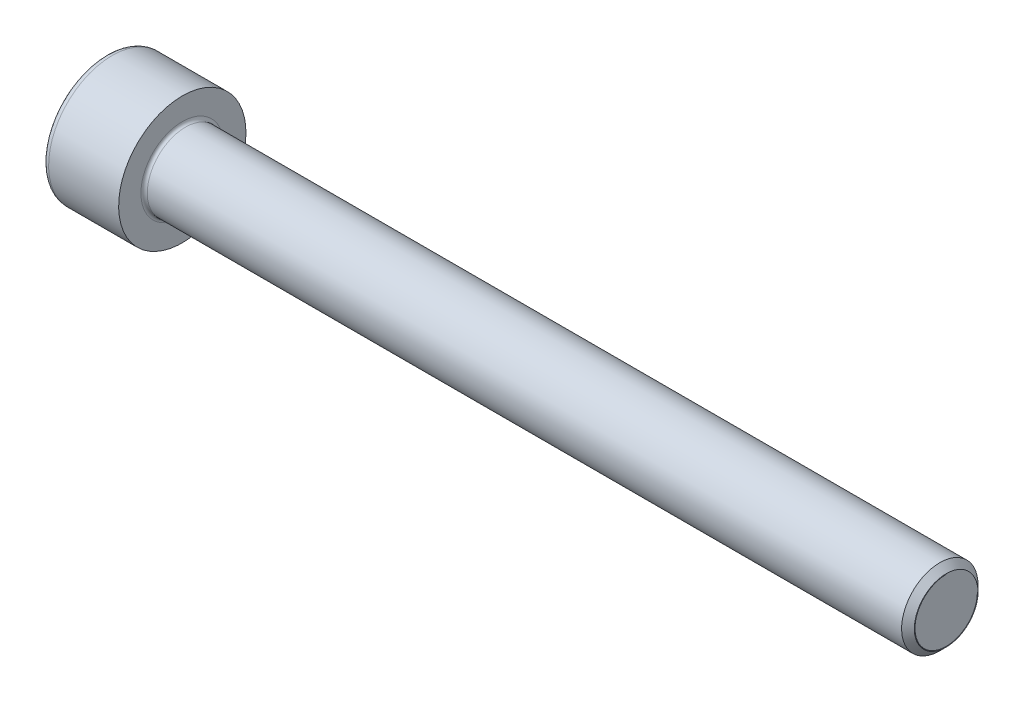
ISO-10303-21;
HEADER;
FILE_DESCRIPTION(('STEP AP214'),'2;1');
FILE_NAME('part.step','',(''),(''),'','','');
FILE_SCHEMA(('AUTOMOTIVE_DESIGN { 1 0 10303 214 1 1 1 1 }'));
ENDSEC;
DATA;
#1=APPLICATION_CONTEXT('core data for automotive mechanical design processes');
#2=APPLICATION_PROTOCOL_DEFINITION('international standard','automotive_design',2000,#1);
#3=PRODUCT_CONTEXT('',#1,'mechanical');
#4=PRODUCT('Part','Part','',(#3));
#5=PRODUCT_RELATED_PRODUCT_CATEGORY('part','',(#4));
#6=PRODUCT_DEFINITION_FORMATION('','',#4);
#7=PRODUCT_DEFINITION_CONTEXT('part definition',#1,'design');
#8=PRODUCT_DEFINITION('design','',#6,#7);
#9=PRODUCT_DEFINITION_SHAPE('','',#8);
#10=(LENGTH_UNIT() NAMED_UNIT(*) SI_UNIT(.MILLI.,.METRE.));
#11=(NAMED_UNIT(*) PLANE_ANGLE_UNIT() SI_UNIT($,.RADIAN.));
#12=(NAMED_UNIT(*) SI_UNIT($,.STERADIAN.) SOLID_ANGLE_UNIT());
#13=UNCERTAINTY_MEASURE_WITH_UNIT(LENGTH_MEASURE(1.E-05),#10,'distance_accuracy_value','');
#14=(GEOMETRIC_REPRESENTATION_CONTEXT(3) GLOBAL_UNCERTAINTY_ASSIGNED_CONTEXT((#13)) GLOBAL_UNIT_ASSIGNED_CONTEXT((#10,
#11,#12)) REPRESENTATION_CONTEXT('',''));
#15=CARTESIAN_POINT('',(0.,0.,0.));
#16=DIRECTION('',(0.,0.,1.));
#17=DIRECTION('',(1.,0.,0.));
#18=AXIS2_PLACEMENT_3D('',#15,#16,#17);
#19=CARTESIAN_POINT('',(-14.4,-14.25,30.5000000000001));
#20=DIRECTION('',(1.,0.,0.));
#21=DIRECTION('',(0.,0.,-1.));
#22=AXIS2_PLACEMENT_3D('',#19,#20,#21);
#23=PLANE('',#22);
#24=DIRECTION('',(0.,0.,1.));
#25=VECTOR('',#24,1.);
#26=CARTESIAN_POINT('',(-14.4,-15.75,29.2625000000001));
#27=LINE('',#26,#25);
#28=CARTESIAN_POINT('',(-14.4,-15.7500000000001,28.0000000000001));
#29=VERTEX_POINT('',#28);
#30=CARTESIAN_POINT('',(-14.4,-15.75,28.0500000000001));
#31=VERTEX_POINT('',#30);
#32=EDGE_CURVE('E249',#29,#31,#27,.T.);
#33=ORIENTED_EDGE('',*,*,#32,.T.);
#34=CARTESIAN_POINT('',(-14.4,-15.75,30.5000000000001));
#35=DIRECTION('',(-1.,0.,0.));
#36=DIRECTION('',(0.,1.,0.));
#37=AXIS2_PLACEMENT_3D('',#34,#35,#36);
#38=CIRCLE('',#37,2.45);
#39=CARTESIAN_POINT('',(-14.4,-13.3,30.5000000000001));
#40=VERTEX_POINT('',#39);
#41=EDGE_CURVE('E97',#31,#40,#38,.T.);
#42=ORIENTED_EDGE('',*,*,#41,.T.);
#43=DIRECTION('',(0.,1.,0.));
#44=VECTOR('',#43,1.);
#45=CARTESIAN_POINT('',(-14.4,-13.7625,30.5000000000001));
#46=LINE('',#45,#44);
#47=CARTESIAN_POINT('',(-14.4,-13.25,30.5000000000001));
#48=VERTEX_POINT('',#47);
#49=EDGE_CURVE('E58',#40,#48,#46,.T.);
#50=ORIENTED_EDGE('',*,*,#49,.T.);
#51=CARTESIAN_POINT('',(-14.4,-15.75,30.5000000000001));
#52=DIRECTION('',(1.,0.,0.));
#53=DIRECTION('',(0.,1.,0.));
#54=AXIS2_PLACEMENT_3D('',#51,#52,#53);
#55=CIRCLE('',#54,2.5);
#56=EDGE_CURVE('E257',#48,#29,#55,.T.);
#57=ORIENTED_EDGE('',*,*,#56,.T.);
#58=EDGE_LOOP('',(#33,#42,#50,#57));
#59=FACE_BOUND('',#58,.T.);
#60=ADVANCED_FACE('F40',(#59),#23,.T.);
#61=CARTESIAN_POINT('',(-32.2750000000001,-15.75,30.5000000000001));
#62=DIRECTION('',(-1.,0.,0.));
#63=DIRECTION('',(0.,0.,1.));
#64=AXIS2_PLACEMENT_3D('',#61,#62,#63);
#65=CYLINDRICAL_SURFACE('',#64,3.);
#66=CARTESIAN_POINT('',(9.1,-15.75,30.5000000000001));
#67=DIRECTION('',(1.,0.,0.));
#68=DIRECTION('',(0.,0.,-1.));
#69=AXIS2_PLACEMENT_3D('',#66,#67,#68);
#70=CIRCLE('',#69,3.);
#71=CARTESIAN_POINT('',(9.1,-15.75,27.5000000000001));
#72=VERTEX_POINT('',#71);
#73=EDGE_CURVE('E11',#72,#72,#70,.F.);
#74=ORIENTED_EDGE('',*,*,#73,.T.);
#75=EDGE_LOOP('',(#74));
#76=FACE_BOUND('',#75,.T.);
#77=CARTESIAN_POINT('',(-50.1499999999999,-15.75,30.5000000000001));
#78=DIRECTION('',(1.,0.,0.));
#79=DIRECTION('',(0.,1.,0.));
#80=AXIS2_PLACEMENT_3D('',#77,#78,#79);
#81=CIRCLE('',#80,3.);
#82=CARTESIAN_POINT('',(-50.1499999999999,-12.75,30.5000000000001));
#83=VERTEX_POINT('',#82);
#84=EDGE_CURVE('E260',#83,#83,#81,.T.);
#85=ORIENTED_EDGE('',*,*,#84,.T.);
#86=EDGE_LOOP('',(#85));
#87=FACE_BOUND('',#86,.T.);
#88=ADVANCED_FACE('F177',(#76,#87),#65,.T.);
#89=CARTESIAN_POINT('',(-50.1499999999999,-15.75,30.5000000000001));
#90=DIRECTION('',(1.,0.,0.));
#91=DIRECTION('',(0.,0.,-1.));
#92=AXIS2_PLACEMENT_3D('',#89,#90,#91);
#93=TOROIDAL_SURFACE('',#92,3.25,0.25);
#94=CARTESIAN_POINT('',(-50.4,-15.75,30.5000000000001));
#95=DIRECTION('',(1.,0.,0.));
#96=DIRECTION('',(0.,1.,0.));
#97=AXIS2_PLACEMENT_3D('',#94,#95,#96);
#98=CIRCLE('',#97,3.25);
#99=CARTESIAN_POINT('',(-50.4,-12.5,30.5000000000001));
#100=VERTEX_POINT('',#99);
#101=EDGE_CURVE('E264',#100,#100,#98,.T.);
#102=ORIENTED_EDGE('',*,*,#101,.T.);
#103=EDGE_LOOP('',(#102));
#104=FACE_BOUND('',#103,.T.);
#105=ORIENTED_EDGE('',*,*,#84,.F.);
#106=EDGE_LOOP('',(#105));
#107=FACE_BOUND('',#106,.T.);
#108=ADVANCED_FACE('F172',(#104,#107),#93,.F.);
#109=CARTESIAN_POINT('',(-50.4,-11.625,30.5000000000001));
#110=DIRECTION('',(1.,0.,0.));
#111=DIRECTION('',(0.,0.,-1.));
#112=AXIS2_PLACEMENT_3D('',#109,#110,#111);
#113=PLANE('',#112);
#114=CARTESIAN_POINT('',(-50.4,-15.75,30.5000000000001));
#115=DIRECTION('',(1.,0.,0.));
#116=DIRECTION('',(0.,1.,0.));
#117=AXIS2_PLACEMENT_3D('',#114,#115,#116);
#118=CIRCLE('',#117,5.);
#119=CARTESIAN_POINT('',(-50.4,-10.75,30.5000000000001));
#120=VERTEX_POINT('',#119);
#121=EDGE_CURVE('E288',#120,#120,#118,.T.);
#122=ORIENTED_EDGE('',*,*,#121,.T.);
#123=EDGE_LOOP('',(#122));
#124=FACE_BOUND('',#123,.T.);
#125=ORIENTED_EDGE('',*,*,#101,.F.);
#126=EDGE_LOOP('',(#125));
#127=FACE_BOUND('',#126,.T.);
#128=ADVANCED_FACE('F176',(#124,#127),#113,.T.);
#129=CARTESIAN_POINT('',(-53.15,-15.75,30.5000000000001));
#130=DIRECTION('',(-1.,0.,0.));
#131=DIRECTION('',(0.,0.,1.));
#132=AXIS2_PLACEMENT_3D('',#129,#130,#131);
#133=CYLINDRICAL_SURFACE('',#132,5.);
#134=CARTESIAN_POINT('',(-55.9000000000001,-15.75,30.5000000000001));
#135=DIRECTION('',(1.,0.,0.));
#136=DIRECTION('',(0.,1.,0.));
#137=AXIS2_PLACEMENT_3D('',#134,#135,#136);
#138=CIRCLE('',#137,5.);
#139=CARTESIAN_POINT('',(-55.9000000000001,-10.75,30.5000000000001));
#140=VERTEX_POINT('',#139);
#141=EDGE_CURVE('E292',#140,#140,#138,.T.);
#142=ORIENTED_EDGE('',*,*,#141,.T.);
#143=EDGE_LOOP('',(#142));
#144=FACE_BOUND('',#143,.T.);
#145=ORIENTED_EDGE('',*,*,#121,.F.);
#146=EDGE_LOOP('',(#145));
#147=FACE_BOUND('',#146,.T.);
#148=ADVANCED_FACE('F182',(#144,#147),#133,.T.);
#149=CARTESIAN_POINT('',(-55.9000000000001,-15.75,30.5000000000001));
#150=DIRECTION('',(1.,0.,0.));
#151=DIRECTION('',(0.,0.,-1.));
#152=AXIS2_PLACEMENT_3D('',#149,#150,#151);
#153=TOROIDAL_SURFACE('',#152,4.49999999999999,0.5);
#154=CARTESIAN_POINT('',(-56.4,-15.75,30.5000000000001));
#155=DIRECTION('',(1.,0.,0.));
#156=DIRECTION('',(0.,1.,0.));
#157=AXIS2_PLACEMENT_3D('',#154,#155,#156);
#158=CIRCLE('',#157,4.5);
#159=CARTESIAN_POINT('',(-56.4,-11.25,30.5000000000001));
#160=VERTEX_POINT('',#159);
#161=EDGE_CURVE('E295',#160,#160,#158,.T.);
#162=ORIENTED_EDGE('',*,*,#161,.T.);
#163=EDGE_LOOP('',(#162));
#164=FACE_BOUND('',#163,.T.);
#165=ORIENTED_EDGE('',*,*,#141,.F.);
#166=EDGE_LOOP('',(#165));
#167=FACE_BOUND('',#166,.T.);
#168=ADVANCED_FACE('F186',(#164,#167),#153,.T.);
#169=CARTESIAN_POINT('',(-56.4,-13.5,30.5000000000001));
#170=DIRECTION('',(-1.,0.,0.));
#171=DIRECTION('',(0.,0.,1.));
#172=AXIS2_PLACEMENT_3D('',#169,#170,#171);
#173=PLANE('',#172);
#174=ORIENTED_EDGE('',*,*,#161,.F.);
#175=EDGE_LOOP('',(#174));
#176=FACE_BOUND('',#175,.T.);
#177=DIRECTION('',(0.,-0.500000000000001,-0.866025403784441));
#178=VECTOR('',#177,1.);
#179=CARTESIAN_POINT('',(-56.4,-17.2729695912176,32.8621392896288));
#180=LINE('',#179,#178);
#181=CARTESIAN_POINT('',(-56.4,-17.1933756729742,33.0000000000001));
#182=VERTEX_POINT('',#181);
#183=CARTESIAN_POINT('',(-56.4,-18.6367513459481,30.5000000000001));
#184=VERTEX_POINT('',#183);
#185=EDGE_CURVE('E166',#182,#184,#180,.T.);
#186=ORIENTED_EDGE('',*,*,#185,.T.);
#187=DIRECTION('',(0.,0.500000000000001,-0.866025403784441));
#188=VECTOR('',#187,1.);
#189=CARTESIAN_POINT('',(-56.4,-17.9946574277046,29.3878607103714));
#190=LINE('',#189,#188);
#191=CARTESIAN_POINT('',(-56.4,-17.1933756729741,28.0000000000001));
#192=VERTEX_POINT('',#191);
#193=EDGE_CURVE('E277',#184,#192,#190,.T.);
#194=ORIENTED_EDGE('',*,*,#193,.T.);
#195=DIRECTION('',(0.,1.,0.));
#196=VECTOR('',#195,1.);
#197=CARTESIAN_POINT('',(-56.4,-15.3466878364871,28.0000000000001));
#198=LINE('',#197,#196);
#199=CARTESIAN_POINT('',(-56.4,-14.306624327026,28.0000000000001));
#200=VERTEX_POINT('',#199);
#201=EDGE_CURVE('E281',#192,#200,#198,.T.);
#202=ORIENTED_EDGE('',*,*,#201,.T.);
#203=DIRECTION('',(0.,0.500000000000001,0.866025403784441));
#204=VECTOR('',#203,1.);
#205=CARTESIAN_POINT('',(-56.4,-13.6645304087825,29.1121392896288));
#206=LINE('',#205,#204);
#207=CARTESIAN_POINT('',(-56.4,-12.8632486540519,30.5000000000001));
#208=VERTEX_POINT('',#207);
#209=EDGE_CURVE('E269',#200,#208,#206,.T.);
#210=ORIENTED_EDGE('',*,*,#209,.T.);
#211=DIRECTION('',(0.,-0.500000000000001,0.866025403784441));
#212=VECTOR('',#211,1.);
#213=CARTESIAN_POINT('',(-56.4,-12.9428425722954,30.6378607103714));
#214=LINE('',#213,#212);
#215=CARTESIAN_POINT('',(-56.4,-14.3066243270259,33.0000000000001));
#216=VERTEX_POINT('',#215);
#217=EDGE_CURVE('E265',#208,#216,#214,.T.);
#218=ORIENTED_EDGE('',*,*,#217,.T.);
#219=DIRECTION('',(0.,-1.,0.));
#220=VECTOR('',#219,1.);
#221=CARTESIAN_POINT('',(-56.4,-13.903312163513,33.0000000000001));
#222=LINE('',#221,#220);
#223=EDGE_CURVE('E270',#216,#182,#222,.T.);
#224=ORIENTED_EDGE('',*,*,#223,.T.);
#225=EDGE_LOOP('',(#186,#194,#202,#210,#218,#224));
#226=FACE_BOUND('',#225,.T.);
#227=ADVANCED_FACE('F190',(#176,#226),#173,.T.);
#228=CARTESIAN_POINT('',(-53.4,-15.75,30.5000000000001));
#229=DIRECTION('',(-1.,0.,0.));
#230=DIRECTION('',(0.,-1.,0.));
#231=AXIS2_PLACEMENT_3D('',#228,#229,#230);
#232=PLANE('',#231);
#233=DIRECTION('',(0.,1.,0.));
#234=VECTOR('',#233,1.);
#235=CARTESIAN_POINT('',(-53.4,-17.1933756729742,33.0000000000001));
#236=LINE('',#235,#234);
#237=CARTESIAN_POINT('',(-53.4,-17.1933756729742,33.0000000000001));
#238=VERTEX_POINT('',#237);
#239=CARTESIAN_POINT('',(-53.4,-14.3066243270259,33.0000000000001));
#240=VERTEX_POINT('',#239);
#241=EDGE_CURVE('E305',#238,#240,#236,.T.);
#242=ORIENTED_EDGE('',*,*,#241,.T.);
#243=DIRECTION('',(0.,0.500000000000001,-0.866025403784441));
#244=VECTOR('',#243,1.);
#245=CARTESIAN_POINT('',(-53.4,-14.3066243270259,33.0000000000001));
#246=LINE('',#245,#244);
#247=CARTESIAN_POINT('',(-53.4,-12.8632486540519,30.5000000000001));
#248=VERTEX_POINT('',#247);
#249=EDGE_CURVE('E302',#240,#248,#246,.T.);
#250=ORIENTED_EDGE('',*,*,#249,.T.);
#251=DIRECTION('',(0.,-0.500000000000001,-0.866025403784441));
#252=VECTOR('',#251,1.);
#253=CARTESIAN_POINT('',(-53.4,-12.8632486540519,30.5000000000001));
#254=LINE('',#253,#252);
#255=CARTESIAN_POINT('',(-53.4,-14.306624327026,28.0000000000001));
#256=VERTEX_POINT('',#255);
#257=EDGE_CURVE('E306',#248,#256,#254,.T.);
#258=ORIENTED_EDGE('',*,*,#257,.T.);
#259=DIRECTION('',(0.,-1.,0.));
#260=VECTOR('',#259,1.);
#261=CARTESIAN_POINT('',(-53.4,-14.306624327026,28.0000000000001));
#262=LINE('',#261,#260);
#263=CARTESIAN_POINT('',(-53.4,-17.1933756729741,28.0000000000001));
#264=VERTEX_POINT('',#263);
#265=EDGE_CURVE('E276',#256,#264,#262,.T.);
#266=ORIENTED_EDGE('',*,*,#265,.T.);
#267=DIRECTION('',(0.,-0.500000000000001,0.866025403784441));
#268=VECTOR('',#267,1.);
#269=CARTESIAN_POINT('',(-53.4,-17.1933756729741,28.0000000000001));
#270=LINE('',#269,#268);
#271=CARTESIAN_POINT('',(-53.4,-18.6367513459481,30.5000000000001));
#272=VERTEX_POINT('',#271);
#273=EDGE_CURVE('E125',#264,#272,#270,.T.);
#274=ORIENTED_EDGE('',*,*,#273,.T.);
#275=DIRECTION('',(0.,0.500000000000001,0.866025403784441));
#276=VECTOR('',#275,1.);
#277=CARTESIAN_POINT('',(-53.4,-18.6367513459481,30.5000000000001));
#278=LINE('',#277,#276);
#279=EDGE_CURVE('E119',#272,#238,#278,.T.);
#280=ORIENTED_EDGE('',*,*,#279,.T.);
#281=EDGE_LOOP('',(#242,#250,#258,#266,#274,#280));
#282=FACE_BOUND('',#281,.T.);
#283=ADVANCED_FACE('F194',(#282),#232,.T.);
#284=CARTESIAN_POINT('',(-53.4,-17.1933756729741,28.0000000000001));
#285=DIRECTION('',(0.,0.,1.));
#286=DIRECTION('',(1.,0.,0.));
#287=AXIS2_PLACEMENT_3D('',#284,#285,#286);
#288=PLANE('',#287);
#289=ORIENTED_EDGE('',*,*,#201,.F.);
#290=DIRECTION('',(-1.,0.,0.));
#291=VECTOR('',#290,1.);
#292=CARTESIAN_POINT('',(-53.4,-17.1933756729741,28.0000000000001));
#293=LINE('',#292,#291);
#294=EDGE_CURVE('E283',#264,#192,#293,.T.);
#295=ORIENTED_EDGE('',*,*,#294,.F.);
#296=ORIENTED_EDGE('',*,*,#265,.F.);
#297=DIRECTION('',(-1.,0.,0.));
#298=VECTOR('',#297,1.);
#299=CARTESIAN_POINT('',(-53.4,-14.306624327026,28.0000000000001));
#300=LINE('',#299,#298);
#301=EDGE_CURVE('E273',#256,#200,#300,.T.);
#302=ORIENTED_EDGE('',*,*,#301,.T.);
#303=EDGE_LOOP('',(#289,#295,#296,#302));
#304=FACE_BOUND('',#303,.T.);
#305=ADVANCED_FACE('F198',(#304),#288,.T.);
#306=CARTESIAN_POINT('',(-53.4,-18.6367513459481,30.5000000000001));
#307=DIRECTION('',(0.,0.866025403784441,0.500000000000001));
#308=DIRECTION('',(0.,-0.500000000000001,0.866025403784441));
#309=AXIS2_PLACEMENT_3D('',#306,#307,#308);
#310=PLANE('',#309);
#311=ORIENTED_EDGE('',*,*,#193,.F.);
#312=DIRECTION('',(-1.,0.,0.));
#313=VECTOR('',#312,1.);
#314=CARTESIAN_POINT('',(-53.4,-18.6367513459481,30.5000000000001));
#315=LINE('',#314,#313);
#316=EDGE_CURVE('E107',#272,#184,#315,.T.);
#317=ORIENTED_EDGE('',*,*,#316,.F.);
#318=ORIENTED_EDGE('',*,*,#273,.F.);
#319=ORIENTED_EDGE('',*,*,#294,.T.);
#320=EDGE_LOOP('',(#311,#317,#318,#319));
#321=FACE_BOUND('',#320,.T.);
#322=ADVANCED_FACE('F202',(#321),#310,.T.);
#323=CARTESIAN_POINT('',(-53.4,-17.1933756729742,33.0000000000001));
#324=DIRECTION('',(0.,0.866025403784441,-0.500000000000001));
#325=DIRECTION('',(0.,0.500000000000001,0.866025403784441));
#326=AXIS2_PLACEMENT_3D('',#323,#324,#325);
#327=PLANE('',#326);
#328=ORIENTED_EDGE('',*,*,#185,.F.);
#329=DIRECTION('',(-1.,0.,0.));
#330=VECTOR('',#329,1.);
#331=CARTESIAN_POINT('',(-53.4,-17.1933756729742,33.0000000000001));
#332=LINE('',#331,#330);
#333=EDGE_CURVE('E117',#238,#182,#332,.T.);
#334=ORIENTED_EDGE('',*,*,#333,.F.);
#335=ORIENTED_EDGE('',*,*,#279,.F.);
#336=ORIENTED_EDGE('',*,*,#316,.T.);
#337=EDGE_LOOP('',(#328,#334,#335,#336));
#338=FACE_BOUND('',#337,.T.);
#339=ADVANCED_FACE('F206',(#338),#327,.T.);
#340=CARTESIAN_POINT('',(-53.4,-14.3066243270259,33.0000000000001));
#341=DIRECTION('',(0.,0.,-1.));
#342=DIRECTION('',(-1.,0.,0.));
#343=AXIS2_PLACEMENT_3D('',#340,#341,#342);
#344=PLANE('',#343);
#345=ORIENTED_EDGE('',*,*,#223,.F.);
#346=DIRECTION('',(-1.,0.,0.));
#347=VECTOR('',#346,1.);
#348=CARTESIAN_POINT('',(-53.4,-14.3066243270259,33.0000000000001));
#349=LINE('',#348,#347);
#350=EDGE_CURVE('E285',#240,#216,#349,.T.);
#351=ORIENTED_EDGE('',*,*,#350,.F.);
#352=ORIENTED_EDGE('',*,*,#241,.F.);
#353=ORIENTED_EDGE('',*,*,#333,.T.);
#354=EDGE_LOOP('',(#345,#351,#352,#353));
#355=FACE_BOUND('',#354,.T.);
#356=ADVANCED_FACE('F209',(#355),#344,.T.);
#357=CARTESIAN_POINT('',(-53.4,-12.8632486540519,30.5000000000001));
#358=DIRECTION('',(0.,-0.866025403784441,-0.500000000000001));
#359=DIRECTION('',(0.,0.500000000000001,-0.866025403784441));
#360=AXIS2_PLACEMENT_3D('',#357,#358,#359);
#361=PLANE('',#360);
#362=ORIENTED_EDGE('',*,*,#217,.F.);
#363=DIRECTION('',(-1.,0.,0.));
#364=VECTOR('',#363,1.);
#365=CARTESIAN_POINT('',(-53.4,-12.8632486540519,30.5000000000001));
#366=LINE('',#365,#364);
#367=EDGE_CURVE('E140',#248,#208,#366,.T.);
#368=ORIENTED_EDGE('',*,*,#367,.F.);
#369=ORIENTED_EDGE('',*,*,#249,.F.);
#370=ORIENTED_EDGE('',*,*,#350,.T.);
#371=EDGE_LOOP('',(#362,#368,#369,#370));
#372=FACE_BOUND('',#371,.T.);
#373=ADVANCED_FACE('F212',(#372),#361,.T.);
#374=CARTESIAN_POINT('',(-53.4,-14.306624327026,28.0000000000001));
#375=DIRECTION('',(0.,-0.866025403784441,0.500000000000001));
#376=DIRECTION('',(0.,-0.500000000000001,-0.866025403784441));
#377=AXIS2_PLACEMENT_3D('',#374,#375,#376);
#378=PLANE('',#377);
#379=ORIENTED_EDGE('',*,*,#209,.F.);
#380=ORIENTED_EDGE('',*,*,#301,.F.);
#381=ORIENTED_EDGE('',*,*,#257,.F.);
#382=ORIENTED_EDGE('',*,*,#367,.T.);
#383=EDGE_LOOP('',(#379,#380,#381,#382));
#384=FACE_BOUND('',#383,.T.);
#385=ADVANCED_FACE('F216',(#384),#378,.T.);
#386=CARTESIAN_POINT('',(9.60000000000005,-15.75,30.5000000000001));
#387=DIRECTION('',(1.,0.,0.));
#388=DIRECTION('',(0.,0.,-1.));
#389=AXIS2_PLACEMENT_3D('',#386,#387,#388);
#390=PLANE('',#389);
#391=DIRECTION('',(0.,0.,-1.));
#392=VECTOR('',#391,1.);
#393=CARTESIAN_POINT('',(9.60000000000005,-15.75,29.2625000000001));
#394=LINE('',#393,#392);
#395=CARTESIAN_POINT('',(9.60000000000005,-15.75,28.0500000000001));
#396=VERTEX_POINT('',#395);
#397=CARTESIAN_POINT('',(9.60000000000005,-15.7500000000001,28.0000000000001));
#398=VERTEX_POINT('',#397);
#399=EDGE_CURVE('E141',#396,#398,#394,.T.);
#400=ORIENTED_EDGE('',*,*,#399,.T.);
#401=CARTESIAN_POINT('',(9.60000000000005,-15.75,30.5000000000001));
#402=DIRECTION('',(1.,0.,0.));
#403=DIRECTION('',(0.,0.,-1.));
#404=AXIS2_PLACEMENT_3D('',#401,#402,#403);
#405=CIRCLE('',#404,2.50000000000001);
#406=CARTESIAN_POINT('',(9.60000000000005,-13.25,30.5000000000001));
#407=VERTEX_POINT('',#406);
#408=EDGE_CURVE('E50',#398,#407,#405,.T.);
#409=ORIENTED_EDGE('',*,*,#408,.T.);
#410=DIRECTION('',(0.,-1.,0.));
#411=VECTOR('',#410,1.);
#412=CARTESIAN_POINT('',(9.60000000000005,-14.5125,30.5000000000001));
#413=LINE('',#412,#411);
#414=CARTESIAN_POINT('',(9.60000000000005,-13.3,30.5000000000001));
#415=VERTEX_POINT('',#414);
#416=EDGE_CURVE('E145',#407,#415,#413,.T.);
#417=ORIENTED_EDGE('',*,*,#416,.T.);
#418=CARTESIAN_POINT('',(9.60000000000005,-15.75,30.5000000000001));
#419=DIRECTION('',(1.,0.,0.));
#420=DIRECTION('',(0.,1.,0.));
#421=AXIS2_PLACEMENT_3D('',#418,#419,#420);
#422=CIRCLE('',#421,2.45);
#423=EDGE_CURVE('E131',#415,#396,#422,.T.);
#424=ORIENTED_EDGE('',*,*,#423,.T.);
#425=EDGE_LOOP('',(#400,#409,#417,#424));
#426=FACE_BOUND('',#425,.T.);
#427=ADVANCED_FACE('F150',(#426),#390,.T.);
#428=CARTESIAN_POINT('',(-2.39999999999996,-15.75,28.0250000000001));
#429=DIRECTION('',(0.,-1.,0.));
#430=DIRECTION('',(0.,0.,-1.));
#431=AXIS2_PLACEMENT_3D('',#428,#429,#430);
#432=PLANE('',#431);
#433=DIRECTION('',(1.,0.,0.));
#434=VECTOR('',#433,1.);
#435=CARTESIAN_POINT('',(9.60000000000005,-15.7500000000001,28.0000000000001));
#436=LINE('',#435,#434);
#437=EDGE_CURVE('E155',#29,#398,#436,.T.);
#438=ORIENTED_EDGE('',*,*,#437,.T.);
#439=ORIENTED_EDGE('',*,*,#399,.F.);
#440=DIRECTION('',(-1.,0.,0.));
#441=VECTOR('',#440,1.);
#442=CARTESIAN_POINT('',(-14.4,-15.75,28.0500000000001));
#443=LINE('',#442,#441);
#444=EDGE_CURVE('E135',#396,#31,#443,.T.);
#445=ORIENTED_EDGE('',*,*,#444,.T.);
#446=ORIENTED_EDGE('',*,*,#32,.F.);
#447=EDGE_LOOP('',(#438,#439,#445,#446));
#448=FACE_BOUND('',#447,.T.);
#449=ADVANCED_FACE('F223',(#448),#432,.T.);
#450=CARTESIAN_POINT('',(-2.39999999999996,-13.275,30.5000000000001));
#451=DIRECTION('',(0.,0.,1.));
#452=DIRECTION('',(1.,0.,0.));
#453=AXIS2_PLACEMENT_3D('',#450,#451,#452);
#454=PLANE('',#453);
#455=ORIENTED_EDGE('',*,*,#49,.F.);
#456=DIRECTION('',(1.,0.,0.));
#457=VECTOR('',#456,1.);
#458=CARTESIAN_POINT('',(-14.4,-13.3,30.5000000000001));
#459=LINE('',#458,#457);
#460=EDGE_CURVE('E133',#40,#415,#459,.T.);
#461=ORIENTED_EDGE('',*,*,#460,.T.);
#462=ORIENTED_EDGE('',*,*,#416,.F.);
#463=DIRECTION('',(-1.,0.,0.));
#464=VECTOR('',#463,1.);
#465=CARTESIAN_POINT('',(9.60000000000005,-13.25,30.5000000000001));
#466=LINE('',#465,#464);
#467=EDGE_CURVE('E147',#407,#48,#466,.T.);
#468=ORIENTED_EDGE('',*,*,#467,.T.);
#469=EDGE_LOOP('',(#455,#461,#462,#468));
#470=FACE_BOUND('',#469,.T.);
#471=ADVANCED_FACE('F144',(#470),#454,.T.);
#472=CARTESIAN_POINT('',(-2.39999999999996,-15.75,30.5000000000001));
#473=DIRECTION('',(-1.,0.,0.));
#474=DIRECTION('',(0.,0.,1.));
#475=AXIS2_PLACEMENT_3D('',#472,#473,#474);
#476=CYLINDRICAL_SURFACE('',#475,2.45);
#477=ORIENTED_EDGE('',*,*,#41,.F.);
#478=ORIENTED_EDGE('',*,*,#444,.F.);
#479=ORIENTED_EDGE('',*,*,#423,.F.);
#480=ORIENTED_EDGE('',*,*,#460,.F.);
#481=EDGE_LOOP('',(#477,#478,#479,#480));
#482=FACE_BOUND('',#481,.T.);
#483=ADVANCED_FACE('F132',(#482),#476,.T.);
#484=CARTESIAN_POINT('',(-2.39999999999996,-15.75,30.5000000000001));
#485=DIRECTION('',(-1.,0.,0.));
#486=DIRECTION('',(0.,0.,1.));
#487=AXIS2_PLACEMENT_3D('',#484,#485,#486);
#488=CYLINDRICAL_SURFACE('',#487,2.5);
#489=ORIENTED_EDGE('',*,*,#437,.F.);
#490=ORIENTED_EDGE('',*,*,#56,.F.);
#491=ORIENTED_EDGE('',*,*,#467,.F.);
#492=CARTESIAN_POINT('',(9.60000000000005,-15.75,30.5000000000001));
#493=DIRECTION('',(-1.,0.,0.));
#494=DIRECTION('',(0.,1.,0.));
#495=AXIS2_PLACEMENT_3D('',#492,#493,#494);
#496=CIRCLE('',#495,2.5);
#497=EDGE_CURVE('E154',#398,#407,#496,.T.);
#498=ORIENTED_EDGE('',*,*,#497,.F.);
#499=EDGE_LOOP('',(#489,#490,#491,#498));
#500=FACE_BOUND('',#499,.T.);
#501=ADVANCED_FACE('F42',(#500),#488,.F.);
#502=CARTESIAN_POINT('',(9.60000000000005,-15.75,30.5000000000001));
#503=DIRECTION('',(-1.,0.,0.));
#504=DIRECTION('',(0.,0.,1.));
#505=AXIS2_PLACEMENT_3D('',#502,#503,#504);
#506=CONICAL_SURFACE('',#505,2.50000000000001,0.785398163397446);
#507=ORIENTED_EDGE('',*,*,#73,.F.);
#508=EDGE_LOOP('',(#507));
#509=FACE_BOUND('',#508,.T.);
#510=ORIENTED_EDGE('',*,*,#497,.T.);
#511=ORIENTED_EDGE('',*,*,#408,.F.);
#512=EDGE_LOOP('',(#510,#511));
#513=FACE_BOUND('',#512,.T.);
#514=ADVANCED_FACE('F232',(#509,#513),#506,.T.);
#515=CLOSED_SHELL('',(#60,#88,#108,#128,#148,#168,#227,#283,#305,#322,#339,#356,#373,#385,#427,
#449,#471,#483,#501,#514));
#516=MANIFOLD_SOLID_BREP('B2',#515);
#517=ADVANCED_BREP_SHAPE_REPRESENTATION('',(#18,#516),#14);
#518=SHAPE_DEFINITION_REPRESENTATION(#9,#517);
ENDSEC;
END-ISO-10303-21;
